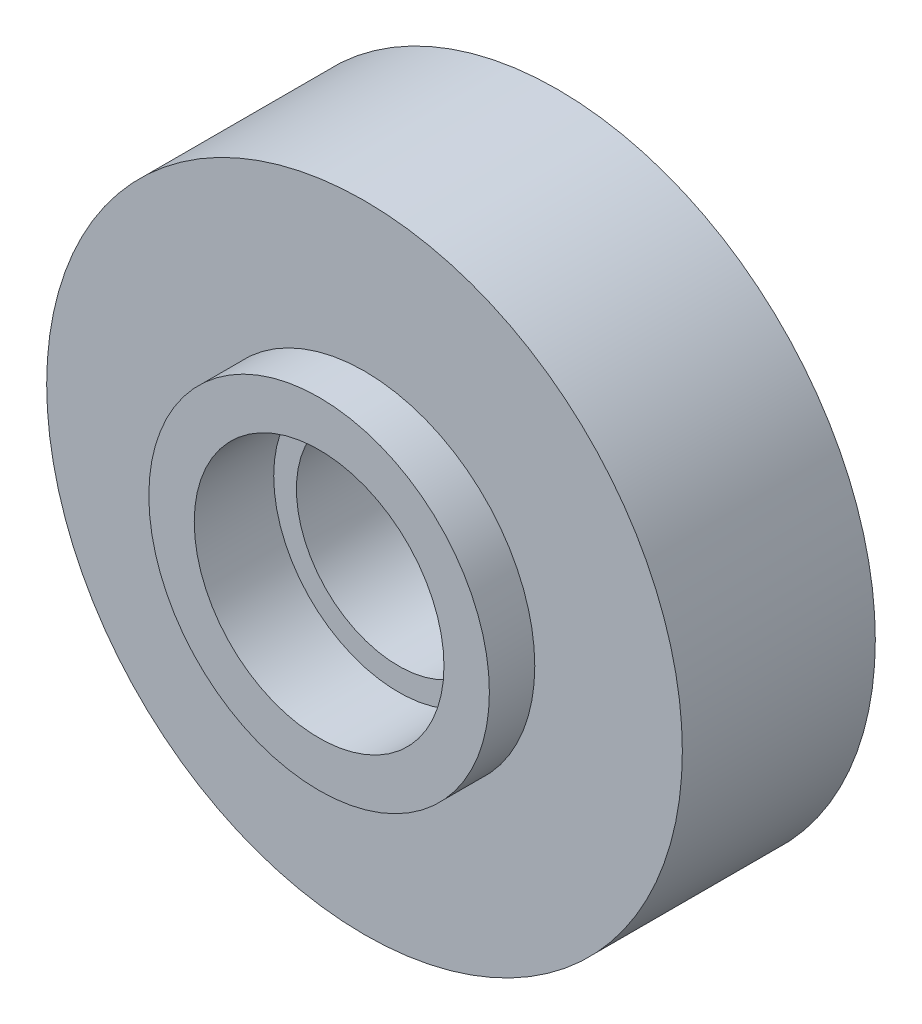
ISO-10303-21;
HEADER;
FILE_DESCRIPTION(('STEP AP214'),'2;1');
FILE_NAME('part.step','',(''),(''),'','','');
FILE_SCHEMA(('AUTOMOTIVE_DESIGN { 1 0 10303 214 1 1 1 1 }'));
ENDSEC;
DATA;
#1=APPLICATION_CONTEXT('core data for automotive mechanical design processes');
#2=APPLICATION_PROTOCOL_DEFINITION('international standard','automotive_design',2000,#1);
#3=PRODUCT_CONTEXT('',#1,'mechanical');
#4=PRODUCT('Part','Part','',(#3));
#5=PRODUCT_RELATED_PRODUCT_CATEGORY('part','',(#4));
#6=PRODUCT_DEFINITION_FORMATION('','',#4);
#7=PRODUCT_DEFINITION_CONTEXT('part definition',#1,'design');
#8=PRODUCT_DEFINITION('design','',#6,#7);
#9=PRODUCT_DEFINITION_SHAPE('','',#8);
#10=(LENGTH_UNIT() NAMED_UNIT(*) SI_UNIT(.MILLI.,.METRE.));
#11=(NAMED_UNIT(*) PLANE_ANGLE_UNIT() SI_UNIT($,.RADIAN.));
#12=(NAMED_UNIT(*) SI_UNIT($,.STERADIAN.) SOLID_ANGLE_UNIT());
#13=UNCERTAINTY_MEASURE_WITH_UNIT(LENGTH_MEASURE(1.E-05),#10,'distance_accuracy_value','');
#14=(GEOMETRIC_REPRESENTATION_CONTEXT(3) GLOBAL_UNCERTAINTY_ASSIGNED_CONTEXT((#13)) GLOBAL_UNIT_ASSIGNED_CONTEXT((#10,
#11,#12)) REPRESENTATION_CONTEXT('',''));
#15=CARTESIAN_POINT('',(0.,0.,0.));
#16=DIRECTION('',(0.,0.,1.));
#17=DIRECTION('',(1.,0.,0.));
#18=AXIS2_PLACEMENT_3D('',#15,#16,#17);
#19=CARTESIAN_POINT('',(0.,0.,17.));
#20=DIRECTION('',(0.,0.,1.));
#21=DIRECTION('',(1.,0.,0.));
#22=AXIS2_PLACEMENT_3D('',#19,#20,#21);
#23=PLANE('',#22);
#24=CARTESIAN_POINT('',(0.,0.,17.));
#25=DIRECTION('',(0.,0.,1.));
#26=DIRECTION('',(1.,0.,0.));
#27=AXIS2_PLACEMENT_3D('',#24,#25,#26);
#28=CIRCLE('',#27,28.);
#29=CARTESIAN_POINT('',(28.,0.,17.));
#30=VERTEX_POINT('',#29);
#31=EDGE_CURVE('E10',#30,#30,#28,.T.);
#32=ORIENTED_EDGE('',*,*,#31,.T.);
#33=EDGE_LOOP('',(#32));
#34=FACE_BOUND('',#33,.T.);
#35=CARTESIAN_POINT('',(0.,0.,17.));
#36=DIRECTION('',(0.,0.,1.));
#37=DIRECTION('',(1.,0.,0.));
#38=AXIS2_PLACEMENT_3D('',#35,#36,#37);
#39=CIRCLE('',#38,15.0000000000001);
#40=CARTESIAN_POINT('',(15.0000000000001,0.,17.));
#41=VERTEX_POINT('',#40);
#42=EDGE_CURVE('E62',#41,#41,#39,.T.);
#43=ORIENTED_EDGE('',*,*,#42,.F.);
#44=EDGE_LOOP('',(#43));
#45=FACE_BOUND('',#44,.T.);
#46=ADVANCED_FACE('F35',(#34,#45),#23,.T.);
#47=CARTESIAN_POINT('',(0.,0.,0.));
#48=DIRECTION('',(0.,0.,1.));
#49=DIRECTION('',(1.,0.,0.));
#50=AXIS2_PLACEMENT_3D('',#47,#48,#49);
#51=CYLINDRICAL_SURFACE('',#50,9.);
#52=CARTESIAN_POINT('',(0.,0.,14.));
#53=DIRECTION('',(0.,0.,1.));
#54=DIRECTION('',(1.,0.,0.));
#55=AXIS2_PLACEMENT_3D('',#52,#53,#54);
#56=CIRCLE('',#55,9.);
#57=CARTESIAN_POINT('',(9.,0.,14.));
#58=VERTEX_POINT('',#57);
#59=EDGE_CURVE('E52',#58,#58,#56,.T.);
#60=ORIENTED_EDGE('',*,*,#59,.T.);
#61=EDGE_LOOP('',(#60));
#62=FACE_BOUND('',#61,.T.);
#63=CARTESIAN_POINT('',(0.,0.,6.5));
#64=DIRECTION('',(0.,0.,-1.));
#65=DIRECTION('',(-1.,0.,0.));
#66=AXIS2_PLACEMENT_3D('',#63,#64,#65);
#67=CIRCLE('',#66,9.);
#68=CARTESIAN_POINT('',(-9.,0.,6.5));
#69=VERTEX_POINT('',#68);
#70=EDGE_CURVE('E39',#69,#69,#67,.F.);
#71=ORIENTED_EDGE('',*,*,#70,.F.);
#72=EDGE_LOOP('',(#71));
#73=FACE_BOUND('',#72,.T.);
#74=ADVANCED_FACE('F89',(#62,#73),#51,.F.);
#75=CARTESIAN_POINT('',(0.,0.,17.));
#76=DIRECTION('',(0.,0.,-1.));
#77=DIRECTION('',(-1.,0.,0.));
#78=AXIS2_PLACEMENT_3D('',#75,#76,#77);
#79=CYLINDRICAL_SURFACE('',#78,28.);
#80=ORIENTED_EDGE('',*,*,#31,.F.);
#81=EDGE_LOOP('',(#80));
#82=FACE_BOUND('',#81,.T.);
#83=CARTESIAN_POINT('',(0.,0.,0.));
#84=DIRECTION('',(0.,0.,1.));
#85=DIRECTION('',(1.,0.,0.));
#86=AXIS2_PLACEMENT_3D('',#83,#84,#85);
#87=CIRCLE('',#86,28.);
#88=CARTESIAN_POINT('',(28.,0.,0.));
#89=VERTEX_POINT('',#88);
#90=EDGE_CURVE('E43',#89,#89,#87,.T.);
#91=ORIENTED_EDGE('',*,*,#90,.T.);
#92=EDGE_LOOP('',(#91));
#93=FACE_BOUND('',#92,.T.);
#94=ADVANCED_FACE('F37',(#82,#93),#79,.T.);
#95=CARTESIAN_POINT('',(0.,0.,0.));
#96=DIRECTION('',(0.,0.,1.));
#97=DIRECTION('',(1.,0.,0.));
#98=AXIS2_PLACEMENT_3D('',#95,#96,#97);
#99=PLANE('',#98);
#100=CARTESIAN_POINT('',(0.,0.,0.));
#101=DIRECTION('',(0.,0.,-1.));
#102=DIRECTION('',(-1.,0.,0.));
#103=AXIS2_PLACEMENT_3D('',#100,#101,#102);
#104=CIRCLE('',#103,11.);
#105=CARTESIAN_POINT('',(-11.,0.,0.));
#106=VERTEX_POINT('',#105);
#107=EDGE_CURVE('E55',#106,#106,#104,.T.);
#108=ORIENTED_EDGE('',*,*,#107,.F.);
#109=EDGE_LOOP('',(#108));
#110=FACE_BOUND('',#109,.T.);
#111=ORIENTED_EDGE('',*,*,#90,.F.);
#112=EDGE_LOOP('',(#111));
#113=FACE_BOUND('',#112,.T.);
#114=ADVANCED_FACE('F99',(#110,#113),#99,.F.);
#115=CARTESIAN_POINT('',(0.,0.,14.));
#116=DIRECTION('',(0.,0.,1.));
#117=DIRECTION('',(1.,0.,0.));
#118=AXIS2_PLACEMENT_3D('',#115,#116,#117);
#119=CYLINDRICAL_SURFACE('',#118,11.);
#120=CARTESIAN_POINT('',(0.,0.,14.));
#121=DIRECTION('',(0.,0.,1.));
#122=DIRECTION('',(1.,0.,0.));
#123=AXIS2_PLACEMENT_3D('',#120,#121,#122);
#124=CIRCLE('',#123,11.);
#125=CARTESIAN_POINT('',(11.,0.,14.));
#126=VERTEX_POINT('',#125);
#127=EDGE_CURVE('E48',#126,#126,#124,.T.);
#128=ORIENTED_EDGE('',*,*,#127,.F.);
#129=EDGE_LOOP('',(#128));
#130=FACE_BOUND('',#129,.T.);
#131=CARTESIAN_POINT('',(0.,0.,21.));
#132=DIRECTION('',(0.,0.,1.));
#133=DIRECTION('',(1.,0.,0.));
#134=AXIS2_PLACEMENT_3D('',#131,#132,#133);
#135=CIRCLE('',#134,11.);
#136=CARTESIAN_POINT('',(11.,0.,21.));
#137=VERTEX_POINT('',#136);
#138=EDGE_CURVE('E65',#137,#137,#135,.T.);
#139=ORIENTED_EDGE('',*,*,#138,.T.);
#140=EDGE_LOOP('',(#139));
#141=FACE_BOUND('',#140,.T.);
#142=ADVANCED_FACE('F71',(#130,#141),#119,.F.);
#143=CARTESIAN_POINT('',(0.,0.,14.));
#144=DIRECTION('',(0.,0.,1.));
#145=DIRECTION('',(1.,0.,0.));
#146=AXIS2_PLACEMENT_3D('',#143,#144,#145);
#147=PLANE('',#146);
#148=ORIENTED_EDGE('',*,*,#59,.F.);
#149=EDGE_LOOP('',(#148));
#150=FACE_BOUND('',#149,.T.);
#151=ORIENTED_EDGE('',*,*,#127,.T.);
#152=EDGE_LOOP('',(#151));
#153=FACE_BOUND('',#152,.T.);
#154=ADVANCED_FACE('F106',(#150,#153),#147,.T.);
#155=CARTESIAN_POINT('',(0.,0.,6.5));
#156=DIRECTION('',(0.,0.,-1.));
#157=DIRECTION('',(-1.,0.,0.));
#158=AXIS2_PLACEMENT_3D('',#155,#156,#157);
#159=PLANE('',#158);
#160=CARTESIAN_POINT('',(0.,0.,6.5));
#161=DIRECTION('',(0.,0.,-1.));
#162=DIRECTION('',(-1.,0.,0.));
#163=AXIS2_PLACEMENT_3D('',#160,#161,#162);
#164=CIRCLE('',#163,11.);
#165=CARTESIAN_POINT('',(-11.,0.,6.5));
#166=VERTEX_POINT('',#165);
#167=EDGE_CURVE('E58',#166,#166,#164,.T.);
#168=ORIENTED_EDGE('',*,*,#167,.T.);
#169=EDGE_LOOP('',(#168));
#170=FACE_BOUND('',#169,.T.);
#171=ORIENTED_EDGE('',*,*,#70,.T.);
#172=EDGE_LOOP('',(#171));
#173=FACE_BOUND('',#172,.T.);
#174=ADVANCED_FACE('F85',(#170,#173),#159,.T.);
#175=CARTESIAN_POINT('',(0.,0.,6.5));
#176=DIRECTION('',(0.,0.,-1.));
#177=DIRECTION('',(-1.,0.,0.));
#178=AXIS2_PLACEMENT_3D('',#175,#176,#177);
#179=CYLINDRICAL_SURFACE('',#178,11.);
#180=CARTESIAN_POINT('',(-11.,0.,6.5));
#181=CARTESIAN_POINT('',(-11.,0.,6.43229166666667));
#182=CARTESIAN_POINT('',(-11.,0.,6.36458333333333));
#183=CARTESIAN_POINT('',(-11.,0.,6.22916666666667));
#184=CARTESIAN_POINT('',(-11.,0.,6.16145833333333));
#185=CARTESIAN_POINT('',(-11.,0.,6.02604166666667));
#186=CARTESIAN_POINT('',(-11.,0.,5.95833333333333));
#187=CARTESIAN_POINT('',(-11.,0.,5.82291666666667));
#188=CARTESIAN_POINT('',(-11.,0.,5.75520833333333));
#189=CARTESIAN_POINT('',(-11.,0.,5.61979166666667));
#190=CARTESIAN_POINT('',(-11.,0.,5.55208333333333));
#191=CARTESIAN_POINT('',(-11.,0.,5.41666666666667));
#192=CARTESIAN_POINT('',(-11.,0.,5.34895833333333));
#193=CARTESIAN_POINT('',(-11.,0.,5.21354166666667));
#194=CARTESIAN_POINT('',(-11.,0.,5.14583333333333));
#195=CARTESIAN_POINT('',(-11.,0.,5.01041666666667));
#196=CARTESIAN_POINT('',(-11.,0.,4.94270833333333));
#197=CARTESIAN_POINT('',(-11.,0.,4.80729166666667));
#198=CARTESIAN_POINT('',(-11.,0.,4.73958333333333));
#199=CARTESIAN_POINT('',(-11.,0.,4.60416666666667));
#200=CARTESIAN_POINT('',(-11.,0.,4.53645833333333));
#201=CARTESIAN_POINT('',(-11.,0.,4.40104166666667));
#202=CARTESIAN_POINT('',(-11.,0.,4.33333333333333));
#203=CARTESIAN_POINT('',(-11.,0.,4.19791666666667));
#204=CARTESIAN_POINT('',(-11.,0.,4.13020833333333));
#205=CARTESIAN_POINT('',(-11.,0.,3.99479166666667));
#206=CARTESIAN_POINT('',(-11.,0.,3.92708333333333));
#207=CARTESIAN_POINT('',(-11.,0.,3.79166666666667));
#208=CARTESIAN_POINT('',(-11.,0.,3.72395833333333));
#209=CARTESIAN_POINT('',(-11.,0.,3.58854166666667));
#210=CARTESIAN_POINT('',(-11.,0.,3.52083333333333));
#211=CARTESIAN_POINT('',(-11.,0.,3.38541666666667));
#212=CARTESIAN_POINT('',(-11.,0.,3.31770833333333));
#213=CARTESIAN_POINT('',(-11.,0.,3.18229166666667));
#214=CARTESIAN_POINT('',(-11.,0.,3.11458333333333));
#215=CARTESIAN_POINT('',(-11.,0.,2.97916666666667));
#216=CARTESIAN_POINT('',(-11.,0.,2.91145833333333));
#217=CARTESIAN_POINT('',(-11.,0.,2.77604166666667));
#218=CARTESIAN_POINT('',(-11.,0.,2.70833333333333));
#219=CARTESIAN_POINT('',(-11.,0.,2.57291666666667));
#220=CARTESIAN_POINT('',(-11.,0.,2.50520833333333));
#221=CARTESIAN_POINT('',(-11.,0.,2.36979166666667));
#222=CARTESIAN_POINT('',(-11.,0.,2.30208333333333));
#223=CARTESIAN_POINT('',(-11.,0.,2.16666666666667));
#224=CARTESIAN_POINT('',(-11.,0.,2.09895833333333));
#225=CARTESIAN_POINT('',(-11.,0.,1.96354166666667));
#226=CARTESIAN_POINT('',(-11.,0.,1.89583333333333));
#227=CARTESIAN_POINT('',(-11.,0.,1.76041666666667));
#228=CARTESIAN_POINT('',(-11.,0.,1.69270833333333));
#229=CARTESIAN_POINT('',(-11.,0.,1.55729166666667));
#230=CARTESIAN_POINT('',(-11.,0.,1.48958333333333));
#231=CARTESIAN_POINT('',(-11.,0.,1.35416666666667));
#232=CARTESIAN_POINT('',(-11.,0.,1.28645833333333));
#233=CARTESIAN_POINT('',(-11.,0.,1.15104166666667));
#234=CARTESIAN_POINT('',(-11.,0.,1.08333333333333));
#235=CARTESIAN_POINT('',(-11.,0.,0.947916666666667));
#236=CARTESIAN_POINT('',(-11.,0.,0.880208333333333));
#237=CARTESIAN_POINT('',(-11.,0.,0.744791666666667));
#238=CARTESIAN_POINT('',(-11.,0.,0.677083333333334));
#239=CARTESIAN_POINT('',(-11.,0.,0.541666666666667));
#240=CARTESIAN_POINT('',(-11.,0.,0.473958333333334));
#241=CARTESIAN_POINT('',(-11.,0.,0.338541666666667));
#242=CARTESIAN_POINT('',(-11.,0.,0.270833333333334));
#243=CARTESIAN_POINT('',(-11.,0.,0.135416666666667));
#244=CARTESIAN_POINT('',(-11.,0.,0.0677083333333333));
#245=CARTESIAN_POINT('',(-11.,0.,0.));
#246=B_SPLINE_CURVE_WITH_KNOTS('',3,(#180,#181,#182,#183,#184,#185,#186,#187,#188,#189,#190,
#191,#192,#193,#194,#195,#196,#197,#198,#199,#200,#201,#202,#203,#204,#205,#206,#207,#208,#209,
#210,#211,#212,#213,#214,#215,#216,#217,#218,#219,#220,#221,#222,#223,#224,#225,#226,#227,#228,
#229,#230,#231,#232,#233,#234,#235,#236,#237,#238,#239,#240,#241,#242,#243,#244,#245),
.UNSPECIFIED.,.F.,.F.,(4,2,2,2,2,2,2,2,2,2,2,2,2,2,2,2,2,2,2,2,2,2,2,2,2,2,2,2,2,2,2,2,4),(0.,
0.203125,0.40625,0.609375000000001,0.812500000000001,1.015625,1.21875,1.421875,1.625,1.828125,
2.03125,2.234375,2.4375,2.640625,2.84375,3.046875,3.25,3.453125,3.65625,3.859375,4.0625,
4.265625,4.46875,4.671875,4.875,5.078125,5.28125,5.484375,5.6875,5.890625,6.09375,6.296875,6.5),.UNSPECIFIED.);
#247=EDGE_CURVE('BSEAM76',#166,#106,#246,.T.);
#248=ORIENTED_EDGE('',*,*,#167,.F.);
#249=ORIENTED_EDGE('',*,*,#107,.T.);
#250=ORIENTED_EDGE('',*,*,#247,.T.);
#251=ORIENTED_EDGE('',*,*,#247,.F.);
#252=EDGE_LOOP('',(#248,#250,#249,#251));
#253=FACE_BOUND('',#252,.T.);
#254=ADVANCED_FACE('F76',(#253),#179,.F.);
#255=CARTESIAN_POINT('',(0.,0.,21.));
#256=DIRECTION('',(0.,0.,1.));
#257=DIRECTION('',(1.,0.,0.));
#258=AXIS2_PLACEMENT_3D('',#255,#256,#257);
#259=PLANE('',#258);
#260=CARTESIAN_POINT('',(0.,0.,21.));
#261=DIRECTION('',(0.,0.,1.));
#262=DIRECTION('',(1.,0.,0.));
#263=AXIS2_PLACEMENT_3D('',#260,#261,#262);
#264=CIRCLE('',#263,15.0000000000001);
#265=CARTESIAN_POINT('',(15.0000000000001,0.,21.));
#266=VERTEX_POINT('',#265);
#267=EDGE_CURVE('E59',#266,#266,#264,.T.);
#268=ORIENTED_EDGE('',*,*,#267,.T.);
#269=EDGE_LOOP('',(#268));
#270=FACE_BOUND('',#269,.T.);
#271=ORIENTED_EDGE('',*,*,#138,.F.);
#272=EDGE_LOOP('',(#271));
#273=FACE_BOUND('',#272,.T.);
#274=ADVANCED_FACE('F73',(#270,#273),#259,.T.);
#275=CARTESIAN_POINT('',(0.,0.,21.));
#276=DIRECTION('',(0.,0.,-1.));
#277=DIRECTION('',(-1.,0.,0.));
#278=AXIS2_PLACEMENT_3D('',#275,#276,#277);
#279=CYLINDRICAL_SURFACE('',#278,15.0000000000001);
#280=ORIENTED_EDGE('',*,*,#267,.F.);
#281=EDGE_LOOP('',(#280));
#282=FACE_BOUND('',#281,.T.);
#283=ORIENTED_EDGE('',*,*,#42,.T.);
#284=EDGE_LOOP('',(#283));
#285=FACE_BOUND('',#284,.T.);
#286=ADVANCED_FACE('F75',(#282,#285),#279,.T.);
#287=CLOSED_SHELL('',(#46,#74,#94,#114,#142,#154,#174,#254,#274,#286));
#288=MANIFOLD_SOLID_BREP('B2',#287);
#289=ADVANCED_BREP_SHAPE_REPRESENTATION('',(#18,#288),#14);
#290=SHAPE_DEFINITION_REPRESENTATION(#9,#289);
ENDSEC;
END-ISO-10303-21;
